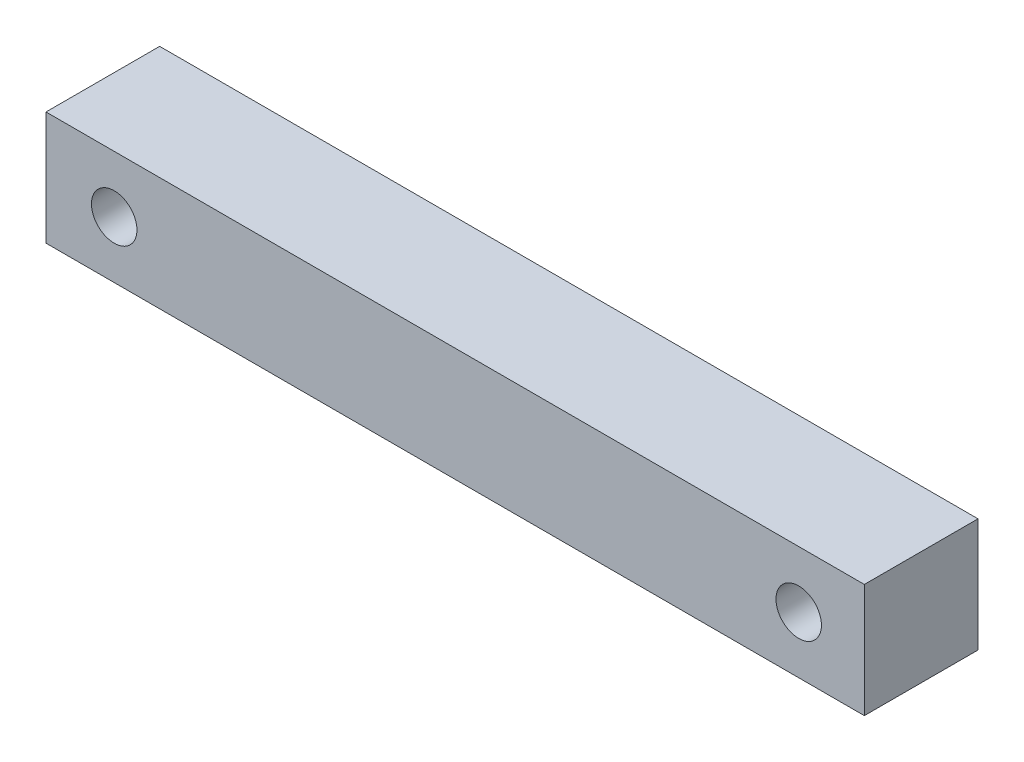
from build123d import *

# Parameters (mm, degrees)
SKETCH1_W           = 36
SKETCH1_H           = 5
BOSS_EXTRUDE1_DEPTH = 5
SKETCH2_R           = 1
CUT_EXTRUDE1_DEPTH  = 5


with BuildPart() as part:
    # Sketch1 → Boss-Extrude1 (new body)
    with BuildSketch(Plane.XY):
        Rectangle(SKETCH1_W, SKETCH1_H)
    extrude(amount=BOSS_EXTRUDE1_DEPTH)

    # Sketch2 → Cut-Extrude1 (cut)
    with BuildSketch(Plane.XY.offset(5)):
        with Locations((-15, 0)):
            Circle(SKETCH2_R)
        with Locations((15.112, 0)):
            Circle(SKETCH2_R)
    extrude(amount=-CUT_EXTRUDE1_DEPTH, mode=Mode.SUBTRACT)


solid = part.part
